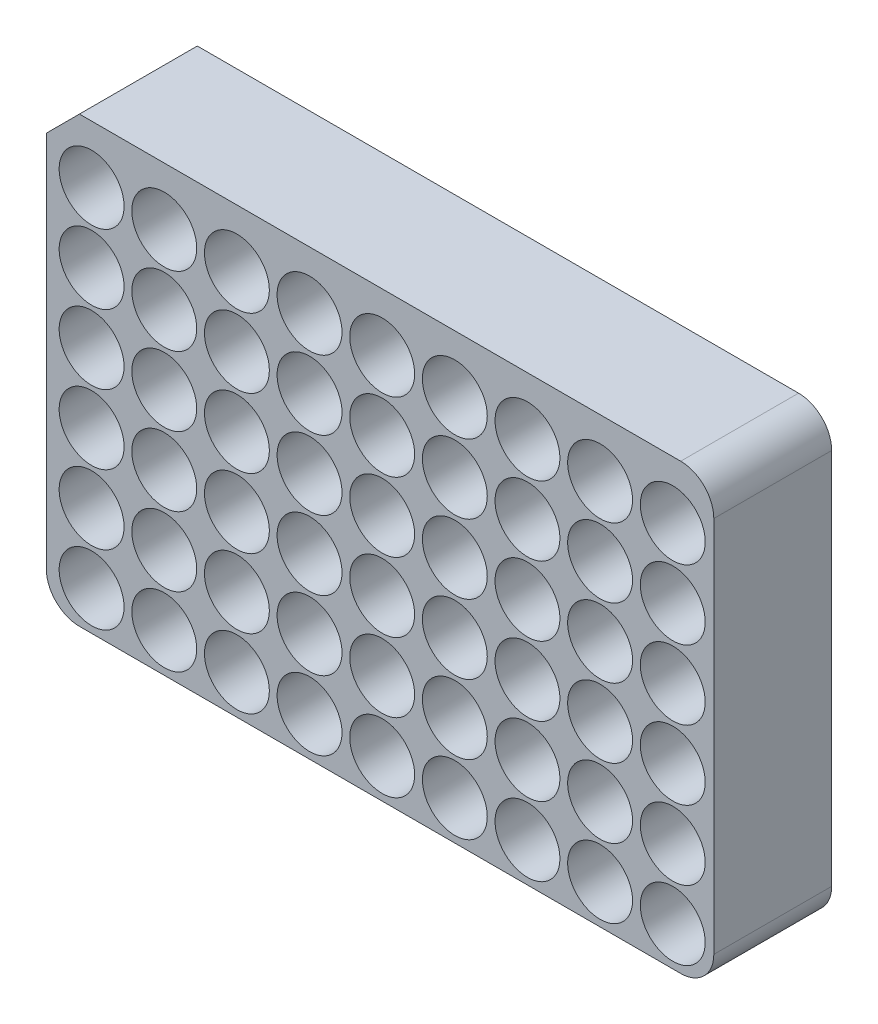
from build123d import *

# Parameters (mm, degrees)
SKETCH1_W            = 128.016
SKETCH1_H            = 85.09
BOSS_EXTRUDE1_DEPTH  = 22.606
FILLET1_R            = 6.35
SKETCH2_R            = 6.223
CUT_EXTRUDE1_DEPTH   = 20.32
LPATTERN1_COUNT      = 9
LPATTERN1_PITCH      = 13.9319
LPATTERN1_COUNT_DIR2 = 6
LPATTERN1_PITCH_DIR2 = 13.3096
CHAMFER1_SIZE        = 6.35


with BuildPart() as part:
    # Sketch1 → Boss-Extrude1 (new body)
    with BuildSketch(Plane.XY):
        Rectangle(SKETCH1_W, SKETCH1_H)
    extrude(amount=BOSS_EXTRUDE1_DEPTH)

    # Fillet1
    fillet1_edges = [part.edges().sort_by_distance(p)[0] for p in [
        (64.008, 42.545, 11.303),
        (64.008, -42.545, 11.303),
        (-64.008, -42.545, 11.303),
    ]]
    fillet(fillet1_edges, radius=FILLET1_R)

    # Sketch2 → Cut-Extrude1 (cut)
    with BuildSketch(Plane.XY.offset(22.606)):
        with Locations((-55.3212, 31.496)):
            Circle(SKETCH2_R)
    cut_extrude1 = extrude(amount=-CUT_EXTRUDE1_DEPTH, mode=Mode.SUBTRACT)

    # LPattern1: Cut-Extrude1 9 × 6
    with Locations(*[(i * LPATTERN1_PITCH, -j * LPATTERN1_PITCH_DIR2, 0) for i in range(LPATTERN1_COUNT) for j in range(LPATTERN1_COUNT_DIR2) if (i, j) != (0, 0)]):
        add(cut_extrude1, mode=Mode.SUBTRACT)

    # Chamfer1
    chamfer1_edges = [part.edges().sort_by_distance(p)[0] for p in [
        (-64.008, 42.545, 11.303),
    ]]
    chamfer(chamfer1_edges, length=CHAMFER1_SIZE)


solid = part.part
